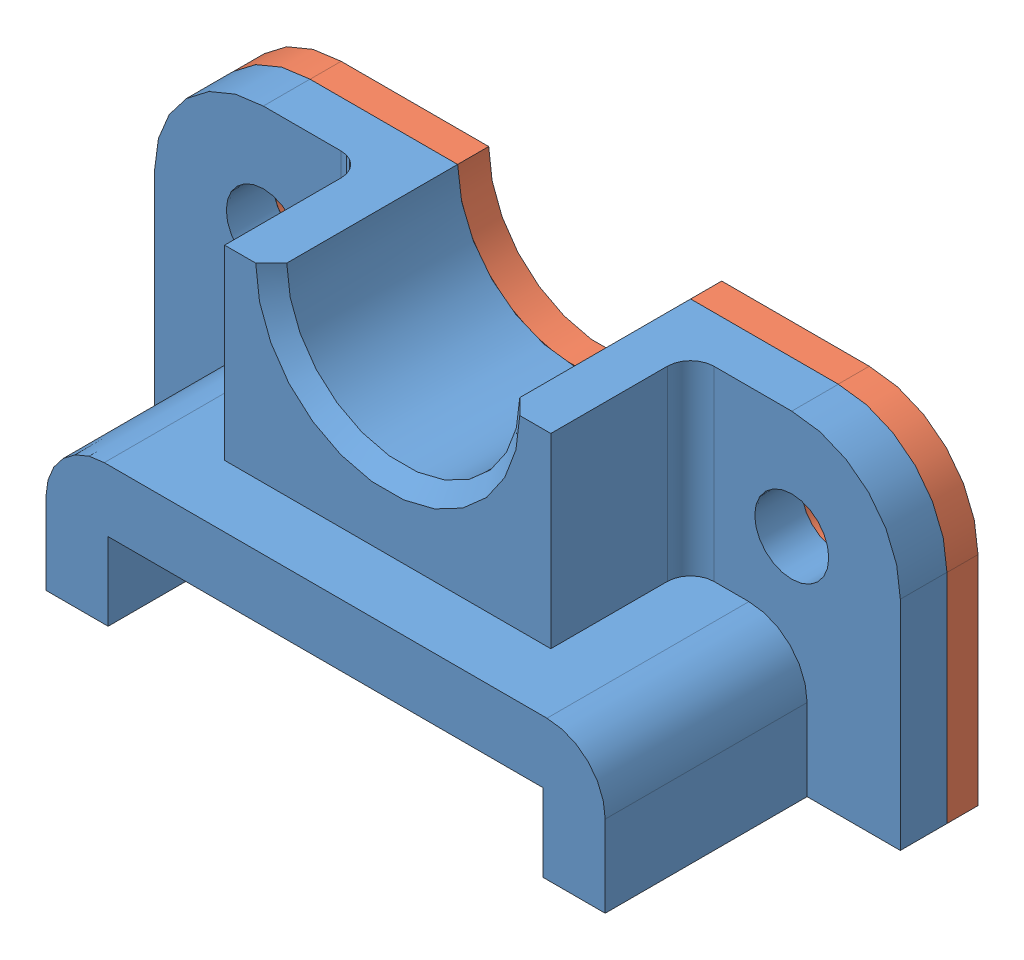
SolidWorks assembly Bearing Plate Assembly.SLDASM, configuration Default (file format 3800). Lengths in mm.
Overall size (101.6 44.45 38.1).
2 component instances, 2 part files, 3 mates.
Components (placement in the parent):
- Bearing Rest-1: Bearing Rest.SLDPRT [Default] at origin size (101.6 44.45 33.87)
- Bearing Plate-1: Bearing Plate.SLDPRT [Default] at (101.6 0 0) size (101.6 44.45 4.23)
Mates (geometry in assembly coordinates):
- Concentric1: concentric aligned: cylinder of Bearing Plate-1; cylinder of Bearing Rest-1
- Coincident1: coincident aligned: plane of Bearing Rest-1 through (101.6 44.45 6.35) normal (0 1 0); plane of Bearing Plate-1 through (34.925 44.45 -4.2333) normal (0 1 0)
- Coincident2: coincident anti-aligned: plane of Bearing Rest-1 through (0 0 0) normal (0 0 -1); plane of Bearing Plate-1 through (86.7833 29.6333 0) normal (0 0 1)
